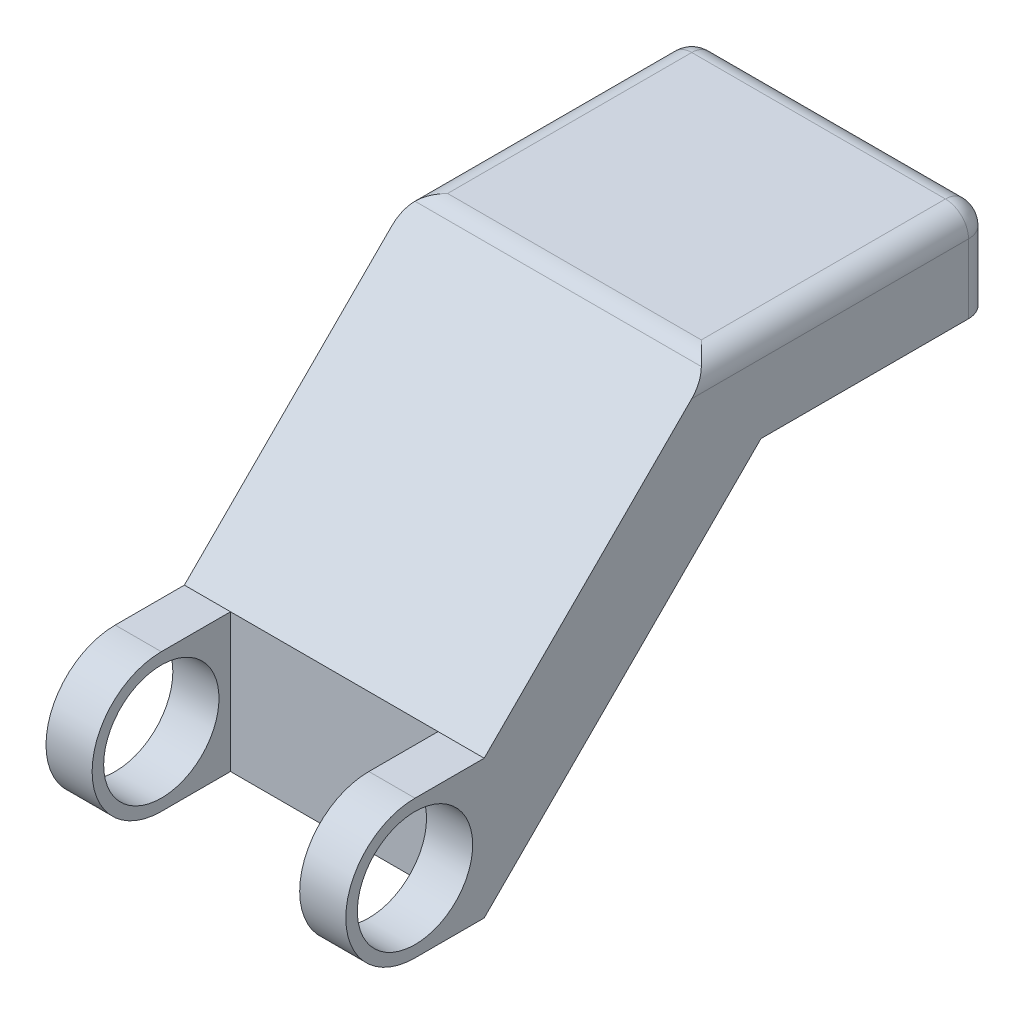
from build123d import *

# Parameters (mm, degrees)
SKETCH1_R               = 12.5
BOSS_EXTRUDE1_DEPTH     = 65
CUT_EXTRUDE1_DEPTH      = 138.20422734
CUT_EXTRUDE1_DEPTH_BACK = 138.20422734
SKETCH2_W               = 45
SKETCH2_H               = 30
FILLET1_R               = 5


with BuildPart() as part:
    # Sketch1 → Boss-Extrude1 (new body)
    with BuildSketch(Plane(origin=(0, 0, 0), x_dir=(0, 0, -1), z_dir=(1, 0, 0))):
        with BuildLine():
            Line((0, 0), (-15, 0))
            ThreePointArc((-15, 0), (-30, 15), (-15, 30))
            Line((-15, 30), (0, 30))
            Line((0, 30), (50, 80))
            Line((50, 80), (110, 80))
            Line((110, 80), (110, 60))
            Line((110, 60), (60, 60))
            Line((60, 60), (0, 0))
        make_face()
        with Locations((-15, 15)):
            Circle(SKETCH1_R, mode=Mode.SUBTRACT)
    extrude(amount=BOSS_EXTRUDE1_DEPTH)

    # Sketch2 → Cut-Extrude1 (cut, two sides: drawn at the far end of the back side and taken through both)
    with BuildSketch(Plane(origin=(0, 30, 0), x_dir=(1, 0, 0), z_dir=(0, 1, 0)).offset(-CUT_EXTRUDE1_DEPTH_BACK)):
        with Locations((32.5, -15)):
            Rectangle(SKETCH2_W, SKETCH2_H)
    extrude(amount=CUT_EXTRUDE1_DEPTH + CUT_EXTRUDE1_DEPTH_BACK, mode=Mode.SUBTRACT)

    # Fillet1
    fillet1_edges = [part.edges().sort_by_distance(p)[0] for p in [
        (0, 80, -80),
        (0, 70, -110),
        (65, 70, -110),
        (32.5, 80, -50),
        (32.5, 80, -110),
        (65, 80, -80),
    ]]
    fillet(fillet1_edges, radius=FILLET1_R)


solid = part.part
